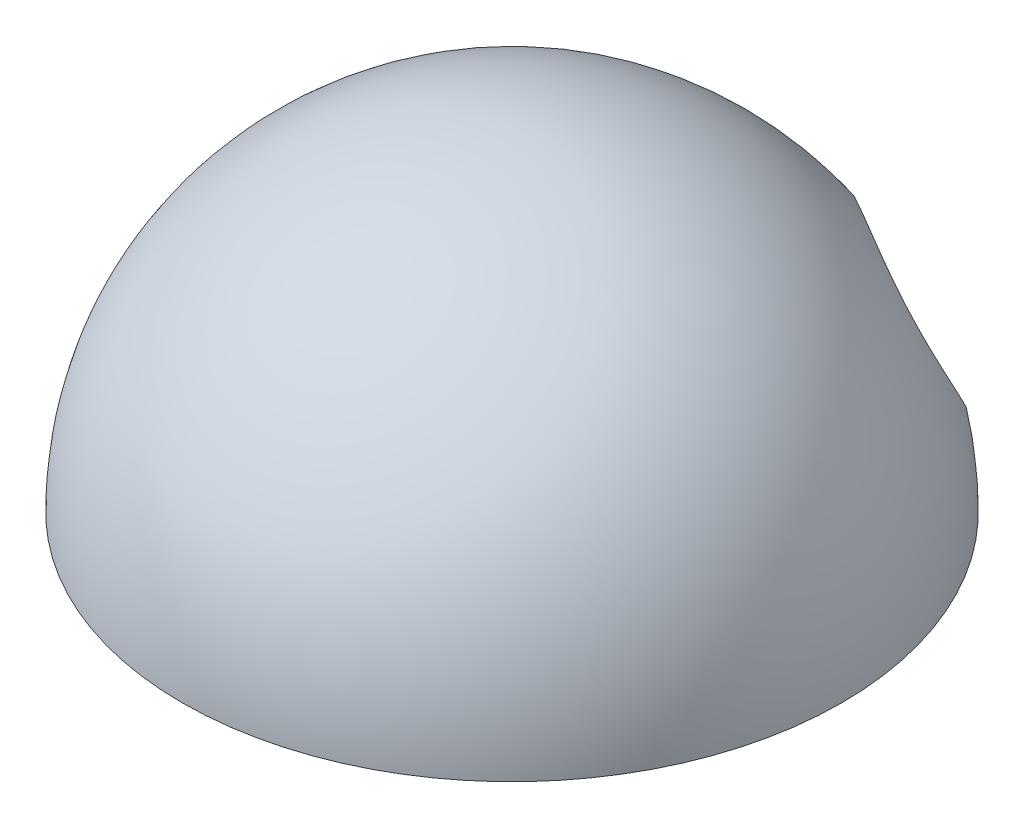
from build123d import *

# Parameters (mm, degrees)
REVOLVE6_ANGLE     = 180
SKETCH3_R          = 8.5
CUT_EXTRUDE1_DEPTH = 50
CUT_REVOLVE1_ANGLE = 90


with BuildPart() as part:
    # Sketch1 → Revolve6 (revolve)
    with BuildSketch(Plane(origin=(0, 0, 0), x_dir=(1, 0, 0), z_dir=(0, 1, 0))):
        with BuildLine():
            Line((-32.5, 0), (32.5, 0))
            ThreePointArc((32.5, 0), (0, 32.5), (-32.5, 0))
        make_face()
    revolve(axis=Axis((-32.5, 0, 0), (1, 0, 0)), revolution_arc=REVOLVE6_ANGLE)

    # Sketch3 → Cut-Extrude1 (cut)
    with BuildSketch(Plane.XY):
        with Locations((-13, 11.5)):
            Circle(SKETCH3_R)
        with Locations((13, 11.5)):
            Circle(SKETCH3_R)
    extrude(amount=-CUT_EXTRUDE1_DEPTH, mode=Mode.SUBTRACT)

    # Sketch5 → Cut-Revolve1 (revolve, cut)
    with BuildSketch(Plane(origin=(0, 0, 0), x_dir=(1, 0, 0), z_dir=(0, 1, 0))):
        with BuildLine():
            Line((-31, 0), (31, 0))
            ThreePointArc((31, 0), (0, -31), (-31, 0))
        make_face()
    revolve(axis=Axis((-31, 0, 0), (-1, 0, 0)), revolution_arc=CUT_REVOLVE1_ANGLE, mode=Mode.SUBTRACT)


solid = part.part
